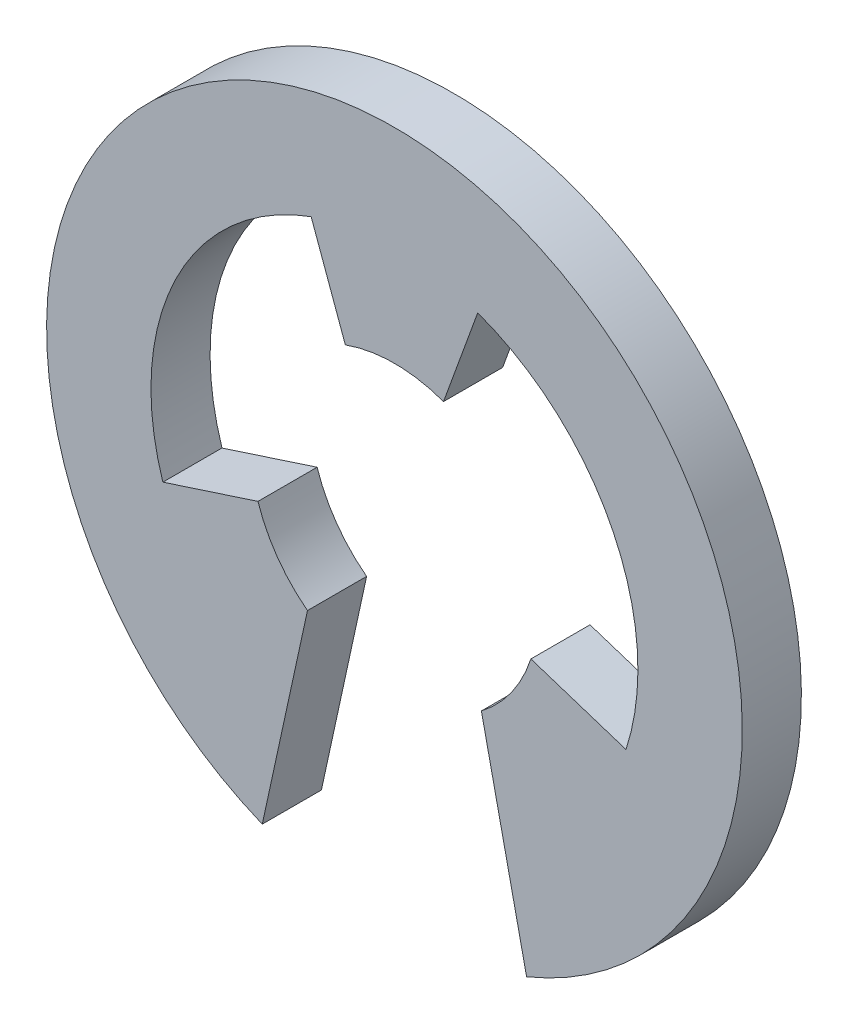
from build123d import *

# Parameters (mm, degrees)
BOSS_EXTRU_1_DEPTH = 0.68


with BuildPart() as part:
    # Esquisse1 → Boss.-Extru.1 (new body)
    with BuildSketch(Plane.XY):
        with BuildLine():
            Line((-1, -1.312440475), (-1.519868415, -3.7))
            ThreePointArc((-1.519868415, -3.7), (0, 4), (1.519868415, -3.7))
            Line((1.519868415, -3.7), (1, -1.312440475))
            ThreePointArc((1, -1.312440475), (1.345837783, -0.954578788), (1.569243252, -0.509878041))
            Line((1.569243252, -0.509878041), (2.662958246, -0.865247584))
            ThreePointArc((2.662958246, -0.865247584), (2.51662333, 1.227439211), (0.957656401, 2.631139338))
            Line((0.957656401, 2.631139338), (0.564333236, 1.550492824))
            ThreePointArc((0.564333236, 1.550492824), (0, 1.65), (-0.564333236, 1.550492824))
            Line((-0.564333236, 1.550492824), (-0.957656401, 2.631139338))
            ThreePointArc((-0.957656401, 2.631139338), (-2.51662333, 1.227439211), (-2.662958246, -0.865247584))
            Line((-2.662958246, -0.865247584), (-1.569243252, -0.509878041))
            ThreePointArc((-1.569243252, -0.509878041), (-1.345837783, -0.954578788), (-1, -1.312440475))
        make_face()
    extrude(amount=BOSS_EXTRU_1_DEPTH)


solid = part.part
